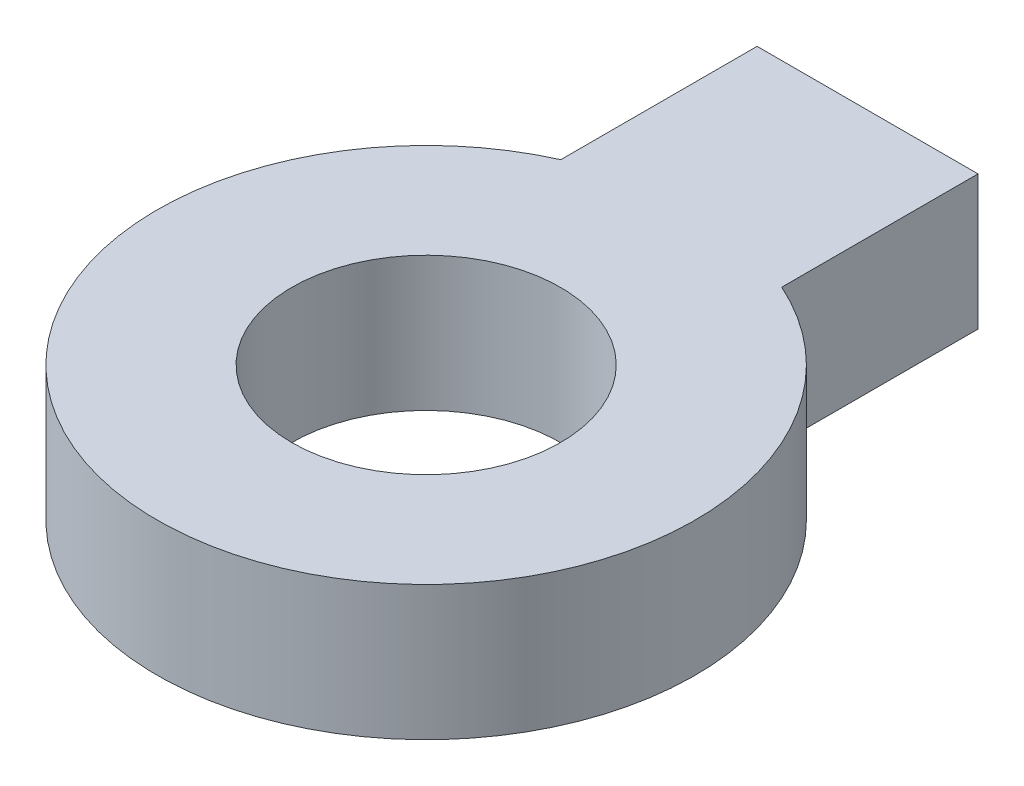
from build123d import *

# Parameters (mm, degrees)
SKETCH1_R           = 3.175
BOSS_EXTRUDE1_DEPTH = 3.175


with BuildPart() as part:
    # Sketch1 → Boss-Extrude1 (new body)
    with BuildSketch(Plane(origin=(0, 0, 0), x_dir=(1, 0, 0), z_dir=(0, 1, 0))):
        with BuildLine():
            Line((-2.608518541, 10.424421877), (2.608518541, 10.424421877))
            Line((2.608518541, 10.424421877), (2.608518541, 5.789484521))
            ThreePointArc((2.608518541, 5.789484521), (0, -6.35), (-2.608518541, 5.789484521))
            Line((-2.608518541, 5.789484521), (-2.608518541, 10.424421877))
        make_face()
        with Locations(Location((0, 0, 0), (0, 0, 270))):
            Circle(SKETCH1_R, mode=Mode.SUBTRACT)
    extrude(amount=BOSS_EXTRUDE1_DEPTH)


solid = part.part
